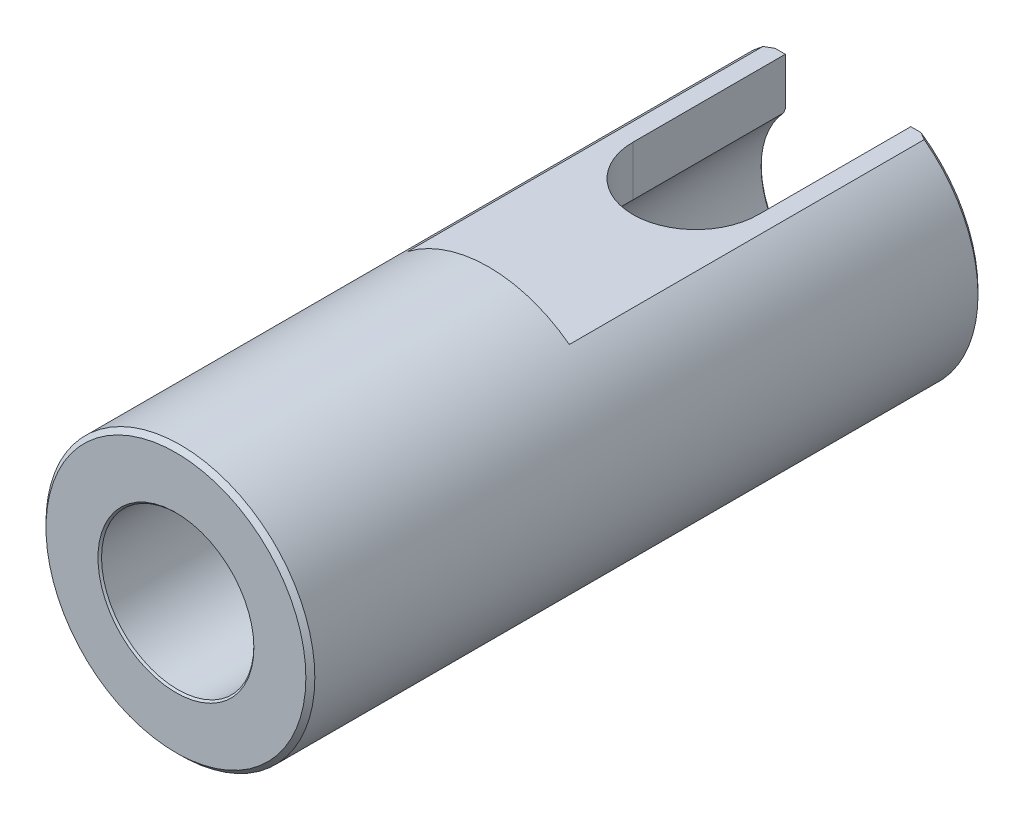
from build123d import *

# Parameters (mm, degrees)
CHANFREIN1_SIZE         = 0.5
CHANFREIN2_SIZE         = 0.2
ESQUISSE2_W             = 32.355298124
ESQUISSE2_H             = 12.226023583
ESQUISSE2_H_2           = 11.838732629
ENL_V_MAT_EXTRU_1_DEPTH = 40.1
ENL_V_MAT_EXTRU_2_REACH = 56.727
TROU_TARAUD_M41_REACH   = 56.727
TROU_TARAUD_M41_BORE_R  = 1.65


with BuildPart() as part:
    # Esquisse1 → R_volution1 (revolve)
    with BuildSketch(Plane(origin=(0, 0, 0), x_dir=(0, 0, -1), z_dir=(1, 0, 0)), mode=Mode.PRIVATE) as r_volution1_sk:
        Polygon((-29.822033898, 8.5), (-29.822033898, 15), (45.177966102, 15), (45.177966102, 9.5), (20.177966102, 9.5), (20.177966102, 8.5), align=None)
    revolve(r_volution1_sk.sketch.rotate(Axis((0, 0, 0), (0, 0, 1)), 90), axis=Axis((0, 0, 0), (0, 0, 1)))

    # Chanfrein1
    chanfrein1_edges = [part.edges().sort_by_distance(p)[0] for p in [
        (15, 0, 29.822033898),
        (15, 0, -45.177966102),
    ]]
    chamfer(chanfrein1_edges, length=CHANFREIN1_SIZE)

    # Chanfrein2
    chanfrein2_edges = [part.edges().sort_by_distance(p)[0] for p in [
        (9.5, 0, -45.177966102),
        (8.5, 0, 29.822033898),
    ]]
    chamfer(chanfrein2_edges, length=CHANFREIN2_SIZE)

    # Esquisse2 → Enl_v. mat.-Extru.1 (cut)
    with BuildSketch(Plane.XY.offset(-45.177966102)):
        with Locations((0.08732874, 18.113011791)):
            Rectangle(ESQUISSE2_W, ESQUISSE2_H)
        with Locations((0.08732874, -17.919366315)):
            Rectangle(ESQUISSE2_W, ESQUISSE2_H_2)
    extrude(amount=ENL_V_MAT_EXTRU_1_DEPTH, mode=Mode.SUBTRACT)

    # Esquisse3 → Enl_v. mat.-Extru.2 (cut, up to next)
    with BuildSketch(Plane(origin=(0, 12, 0), x_dir=(1, 0, 0), z_dir=(0, 1, 0)), mode=Mode.PRIVATE) as enl_v_mat_extru_2_sk1:
        with BuildLine():
            Line((7, 28.177966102), (7, 45.177966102))
            Line((7, 45.177966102), (-7, 45.177966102))
            Line((-7, 45.177966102), (-7, 28.177966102))
            ThreePointArc((-7, 28.177966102), (0, 21.177966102), (7, 28.177966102))
        make_face()
    enl_v_mat_extru_2_tool1 = extrude(enl_v_mat_extru_2_sk1.sketch, amount=-ENL_V_MAT_EXTRU_2_REACH, mode=Mode.PRIVATE) & part.part
    add(enl_v_mat_extru_2_tool1.solids().sort_by_distance((0, 12, -33.874823))[0], mode=Mode.SUBTRACT)

    # Trou taraud_ M41 bore → Trou taraud_ M41 (cut, up to next)
    with BuildSketch(Plane(origin=(0, -12, 0), x_dir=(-1, 0, 0), z_dir=(0, -1, 0)), mode=Mode.PRIVATE) as trou_taraud_m41_sk1:
        with Locations((0, 15.177966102)):
            Circle(TROU_TARAUD_M41_BORE_R)
    trou_taraud_m41_tool1 = extrude(trou_taraud_m41_sk1.sketch, amount=-TROU_TARAUD_M41_REACH, mode=Mode.PRIVATE) & part.part
    add(trou_taraud_m41_tool1.solids().sort_by_distance((0, -12, -15.177966))[0], mode=Mode.SUBTRACT)


solid = part.part
